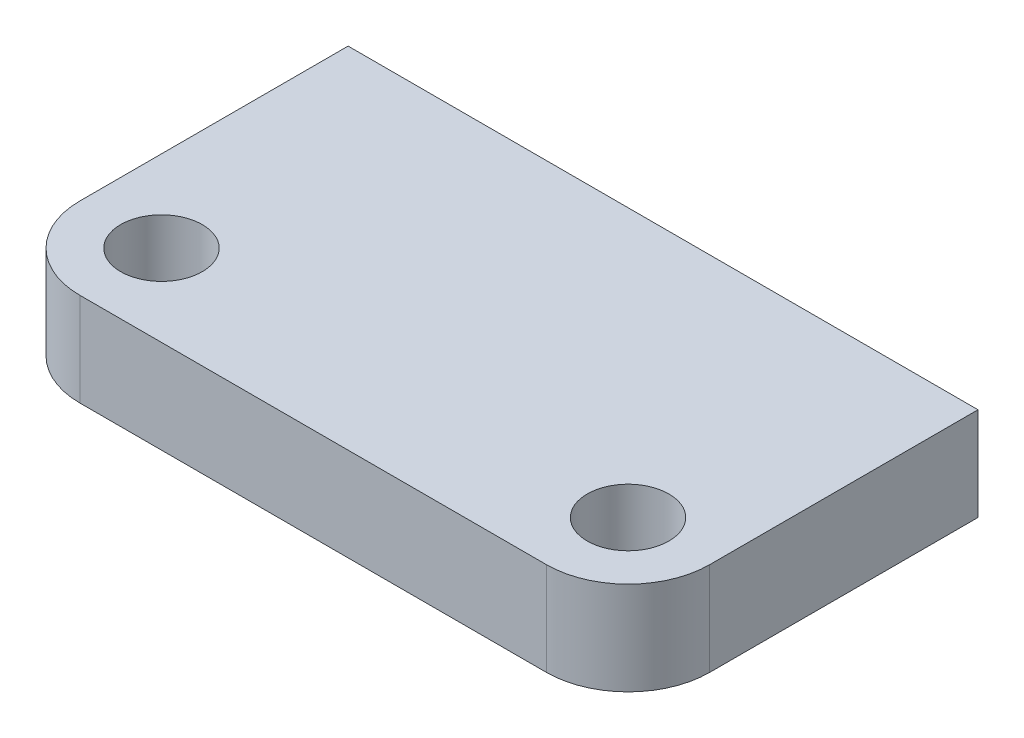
ISO-10303-21;
HEADER;
FILE_DESCRIPTION(('STEP AP214'),'2;1');
FILE_NAME('part.step','',(''),(''),'','','');
FILE_SCHEMA(('AUTOMOTIVE_DESIGN { 1 0 10303 214 1 1 1 1 }'));
ENDSEC;
DATA;
#1=APPLICATION_CONTEXT('core data for automotive mechanical design processes');
#2=APPLICATION_PROTOCOL_DEFINITION('international standard','automotive_design',2000,#1);
#3=PRODUCT_CONTEXT('',#1,'mechanical');
#4=PRODUCT('Part','Part','',(#3));
#5=PRODUCT_RELATED_PRODUCT_CATEGORY('part','',(#4));
#6=PRODUCT_DEFINITION_FORMATION('','',#4);
#7=PRODUCT_DEFINITION_CONTEXT('part definition',#1,'design');
#8=PRODUCT_DEFINITION('design','',#6,#7);
#9=PRODUCT_DEFINITION_SHAPE('','',#8);
#10=(LENGTH_UNIT() NAMED_UNIT(*) SI_UNIT(.MILLI.,.METRE.));
#11=(NAMED_UNIT(*) PLANE_ANGLE_UNIT() SI_UNIT($,.RADIAN.));
#12=(NAMED_UNIT(*) SI_UNIT($,.STERADIAN.) SOLID_ANGLE_UNIT());
#13=UNCERTAINTY_MEASURE_WITH_UNIT(LENGTH_MEASURE(1.E-05),#10,'distance_accuracy_value','');
#14=(GEOMETRIC_REPRESENTATION_CONTEXT(3) GLOBAL_UNCERTAINTY_ASSIGNED_CONTEXT((#13)) GLOBAL_UNIT_ASSIGNED_CONTEXT((#10,
#11,#12)) REPRESENTATION_CONTEXT('',''));
#15=CARTESIAN_POINT('',(0.,0.,0.));
#16=DIRECTION('',(0.,0.,1.));
#17=DIRECTION('',(1.,0.,0.));
#18=AXIS2_PLACEMENT_3D('',#15,#16,#17);
#19=CARTESIAN_POINT('',(-20.,8.,23.));
#20=DIRECTION('',(0.,-1.,0.));
#21=DIRECTION('',(0.,0.,-1.));
#22=AXIS2_PLACEMENT_3D('',#19,#20,#21);
#23=PLANE('',#22);
#24=CARTESIAN_POINT('',(-20.,8.,23.));
#25=DIRECTION('',(0.,1.,0.));
#26=DIRECTION('',(0.,0.,1.));
#27=AXIS2_PLACEMENT_3D('',#24,#25,#26);
#28=CIRCLE('',#27,3.5);
#29=CARTESIAN_POINT('',(-20.,8.,26.5));
#30=VERTEX_POINT('',#29);
#31=EDGE_CURVE('E120',#30,#30,#28,.T.);
#32=ORIENTED_EDGE('',*,*,#31,.F.);
#33=EDGE_LOOP('',(#32));
#34=FACE_BOUND('',#33,.T.);
#35=DIRECTION('',(0.,0.,1.));
#36=VECTOR('',#35,1.);
#37=CARTESIAN_POINT('',(-27.,8.,0.));
#38=LINE('',#37,#36);
#39=CARTESIAN_POINT('',(-27.,8.,0.));
#40=VERTEX_POINT('',#39);
#41=CARTESIAN_POINT('',(-27.,8.,23.));
#42=VERTEX_POINT('',#41);
#43=EDGE_CURVE('E127',#40,#42,#38,.T.);
#44=ORIENTED_EDGE('',*,*,#43,.T.);
#45=CARTESIAN_POINT('',(-20.,8.,23.));
#46=DIRECTION('',(0.,1.,0.));
#47=DIRECTION('',(0.,0.,-1.));
#48=AXIS2_PLACEMENT_3D('',#45,#46,#47);
#49=CIRCLE('',#48,7.);
#50=CARTESIAN_POINT('',(-19.9999999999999,8.,30.));
#51=VERTEX_POINT('',#50);
#52=EDGE_CURVE('E85',#42,#51,#49,.T.);
#53=ORIENTED_EDGE('',*,*,#52,.T.);
#54=DIRECTION('',(1.,0.,0.));
#55=VECTOR('',#54,1.);
#56=CARTESIAN_POINT('',(-19.9999999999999,8.,30.));
#57=LINE('',#56,#55);
#58=CARTESIAN_POINT('',(19.9999999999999,8.,30.));
#59=VERTEX_POINT('',#58);
#60=EDGE_CURVE('E98',#51,#59,#57,.T.);
#61=ORIENTED_EDGE('',*,*,#60,.T.);
#62=CARTESIAN_POINT('',(20.,8.,23.));
#63=DIRECTION('',(0.,1.,0.));
#64=DIRECTION('',(0.,0.,1.));
#65=AXIS2_PLACEMENT_3D('',#62,#63,#64);
#66=CIRCLE('',#65,7.);
#67=CARTESIAN_POINT('',(27.,8.,23.));
#68=VERTEX_POINT('',#67);
#69=EDGE_CURVE('E92',#59,#68,#66,.T.);
#70=ORIENTED_EDGE('',*,*,#69,.T.);
#71=DIRECTION('',(0.,0.,-1.));
#72=VECTOR('',#71,1.);
#73=CARTESIAN_POINT('',(27.,8.,0.));
#74=LINE('',#73,#72);
#75=CARTESIAN_POINT('',(27.,8.,0.));
#76=VERTEX_POINT('',#75);
#77=EDGE_CURVE('E96',#68,#76,#74,.T.);
#78=ORIENTED_EDGE('',*,*,#77,.T.);
#79=DIRECTION('',(-1.,0.,0.));
#80=VECTOR('',#79,1.);
#81=CARTESIAN_POINT('',(27.,8.,0.));
#82=LINE('',#81,#80);
#83=EDGE_CURVE('E48',#76,#40,#82,.T.);
#84=ORIENTED_EDGE('',*,*,#83,.T.);
#85=EDGE_LOOP('',(#44,#53,#61,#70,#78,#84));
#86=FACE_BOUND('',#85,.T.);
#87=CARTESIAN_POINT('',(20.,8.,23.));
#88=DIRECTION('',(0.,1.,0.));
#89=DIRECTION('',(0.,0.,-1.));
#90=AXIS2_PLACEMENT_3D('',#87,#88,#89);
#91=CIRCLE('',#90,3.5);
#92=CARTESIAN_POINT('',(20.,8.,19.5));
#93=VERTEX_POINT('',#92);
#94=EDGE_CURVE('E170',#93,#93,#91,.T.);
#95=ORIENTED_EDGE('',*,*,#94,.F.);
#96=EDGE_LOOP('',(#95));
#97=FACE_BOUND('',#96,.T.);
#98=ADVANCED_FACE('F31',(#34,#86,#97),#23,.F.);
#99=CARTESIAN_POINT('',(-20.,0.,23.));
#100=DIRECTION('',(0.,-1.,0.));
#101=DIRECTION('',(0.,0.,-1.));
#102=AXIS2_PLACEMENT_3D('',#99,#100,#101);
#103=PLANE('',#102);
#104=CARTESIAN_POINT('',(-20.,0.,23.));
#105=DIRECTION('',(0.,1.,0.));
#106=DIRECTION('',(0.,0.,1.));
#107=AXIS2_PLACEMENT_3D('',#104,#105,#106);
#108=CIRCLE('',#107,3.5);
#109=CARTESIAN_POINT('',(-20.,0.,26.5));
#110=VERTEX_POINT('',#109);
#111=EDGE_CURVE('E175',#110,#110,#108,.T.);
#112=ORIENTED_EDGE('',*,*,#111,.T.);
#113=EDGE_LOOP('',(#112));
#114=FACE_BOUND('',#113,.T.);
#115=DIRECTION('',(0.,0.,1.));
#116=VECTOR('',#115,1.);
#117=CARTESIAN_POINT('',(-27.,0.,0.));
#118=LINE('',#117,#116);
#119=CARTESIAN_POINT('',(-27.,0.,0.));
#120=VERTEX_POINT('',#119);
#121=CARTESIAN_POINT('',(-27.,0.,23.));
#122=VERTEX_POINT('',#121);
#123=EDGE_CURVE('E116',#120,#122,#118,.T.);
#124=ORIENTED_EDGE('',*,*,#123,.F.);
#125=DIRECTION('',(-1.,0.,0.));
#126=VECTOR('',#125,1.);
#127=CARTESIAN_POINT('',(27.,0.,0.));
#128=LINE('',#127,#126);
#129=CARTESIAN_POINT('',(27.,0.,0.));
#130=VERTEX_POINT('',#129);
#131=EDGE_CURVE('E77',#130,#120,#128,.T.);
#132=ORIENTED_EDGE('',*,*,#131,.F.);
#133=DIRECTION('',(0.,0.,-1.));
#134=VECTOR('',#133,1.);
#135=CARTESIAN_POINT('',(27.,0.,0.));
#136=LINE('',#135,#134);
#137=CARTESIAN_POINT('',(27.,0.,23.));
#138=VERTEX_POINT('',#137);
#139=EDGE_CURVE('E71',#138,#130,#136,.T.);
#140=ORIENTED_EDGE('',*,*,#139,.F.);
#141=CARTESIAN_POINT('',(20.,0.,23.));
#142=DIRECTION('',(0.,1.,0.));
#143=DIRECTION('',(0.,0.,1.));
#144=AXIS2_PLACEMENT_3D('',#141,#142,#143);
#145=CIRCLE('',#144,7.);
#146=CARTESIAN_POINT('',(19.9999999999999,0.,30.));
#147=VERTEX_POINT('',#146);
#148=EDGE_CURVE('E106',#147,#138,#145,.T.);
#149=ORIENTED_EDGE('',*,*,#148,.F.);
#150=DIRECTION('',(1.,0.,0.));
#151=VECTOR('',#150,1.);
#152=CARTESIAN_POINT('',(-19.9999999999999,0.,30.));
#153=LINE('',#152,#151);
#154=CARTESIAN_POINT('',(-19.9999999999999,0.,30.));
#155=VERTEX_POINT('',#154);
#156=EDGE_CURVE('E122',#155,#147,#153,.T.);
#157=ORIENTED_EDGE('',*,*,#156,.F.);
#158=CARTESIAN_POINT('',(-20.,0.,23.));
#159=DIRECTION('',(0.,1.,0.));
#160=DIRECTION('',(0.,0.,-1.));
#161=AXIS2_PLACEMENT_3D('',#158,#159,#160);
#162=CIRCLE('',#161,7.);
#163=EDGE_CURVE('E119',#122,#155,#162,.T.);
#164=ORIENTED_EDGE('',*,*,#163,.F.);
#165=EDGE_LOOP('',(#124,#132,#140,#149,#157,#164));
#166=FACE_BOUND('',#165,.T.);
#167=CARTESIAN_POINT('',(20.,0.,23.));
#168=DIRECTION('',(0.,1.,0.));
#169=DIRECTION('',(0.,0.,-1.));
#170=AXIS2_PLACEMENT_3D('',#167,#168,#169);
#171=CIRCLE('',#170,3.5);
#172=CARTESIAN_POINT('',(20.,0.,19.5));
#173=VERTEX_POINT('',#172);
#174=EDGE_CURVE('E173',#173,#173,#171,.T.);
#175=ORIENTED_EDGE('',*,*,#174,.T.);
#176=EDGE_LOOP('',(#175));
#177=FACE_BOUND('',#176,.T.);
#178=ADVANCED_FACE('F136',(#114,#166,#177),#103,.T.);
#179=CARTESIAN_POINT('',(-27.,8.,0.));
#180=DIRECTION('',(1.,0.,0.));
#181=DIRECTION('',(0.,0.,-1.));
#182=AXIS2_PLACEMENT_3D('',#179,#180,#181);
#183=PLANE('',#182);
#184=ORIENTED_EDGE('',*,*,#123,.T.);
#185=DIRECTION('',(0.,-1.,0.));
#186=VECTOR('',#185,1.);
#187=CARTESIAN_POINT('',(-27.,8.,23.));
#188=LINE('',#187,#186);
#189=EDGE_CURVE('E11',#42,#122,#188,.T.);
#190=ORIENTED_EDGE('',*,*,#189,.F.);
#191=ORIENTED_EDGE('',*,*,#43,.F.);
#192=DIRECTION('',(0.,-1.,0.));
#193=VECTOR('',#192,1.);
#194=CARTESIAN_POINT('',(-27.,8.,0.));
#195=LINE('',#194,#193);
#196=EDGE_CURVE('E112',#40,#120,#195,.T.);
#197=ORIENTED_EDGE('',*,*,#196,.T.);
#198=EDGE_LOOP('',(#184,#190,#191,#197));
#199=FACE_BOUND('',#198,.T.);
#200=ADVANCED_FACE('F33',(#199),#183,.F.);
#201=CARTESIAN_POINT('',(-20.,8.,23.));
#202=DIRECTION('',(0.,-1.,0.));
#203=DIRECTION('',(0.,0.,-1.));
#204=AXIS2_PLACEMENT_3D('',#201,#202,#203);
#205=CYLINDRICAL_SURFACE('',#204,7.);
#206=ORIENTED_EDGE('',*,*,#163,.T.);
#207=DIRECTION('',(0.,-1.,0.));
#208=VECTOR('',#207,1.);
#209=CARTESIAN_POINT('',(-19.9999999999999,8.,30.));
#210=LINE('',#209,#208);
#211=EDGE_CURVE('E40',#51,#155,#210,.T.);
#212=ORIENTED_EDGE('',*,*,#211,.F.);
#213=ORIENTED_EDGE('',*,*,#52,.F.);
#214=ORIENTED_EDGE('',*,*,#189,.T.);
#215=EDGE_LOOP('',(#206,#212,#213,#214));
#216=FACE_BOUND('',#215,.T.);
#217=ADVANCED_FACE('F216',(#216),#205,.T.);
#218=CARTESIAN_POINT('',(-19.9999999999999,8.,30.));
#219=DIRECTION('',(0.,0.,-1.));
#220=DIRECTION('',(-1.,0.,0.));
#221=AXIS2_PLACEMENT_3D('',#218,#219,#220);
#222=PLANE('',#221);
#223=ORIENTED_EDGE('',*,*,#156,.T.);
#224=DIRECTION('',(0.,-1.,0.));
#225=VECTOR('',#224,1.);
#226=CARTESIAN_POINT('',(19.9999999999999,8.,30.));
#227=LINE('',#226,#225);
#228=EDGE_CURVE('E107',#59,#147,#227,.T.);
#229=ORIENTED_EDGE('',*,*,#228,.F.);
#230=ORIENTED_EDGE('',*,*,#60,.F.);
#231=ORIENTED_EDGE('',*,*,#211,.T.);
#232=EDGE_LOOP('',(#223,#229,#230,#231));
#233=FACE_BOUND('',#232,.T.);
#234=ADVANCED_FACE('F133',(#233),#222,.F.);
#235=CARTESIAN_POINT('',(20.,8.,23.));
#236=DIRECTION('',(0.,-1.,0.));
#237=DIRECTION('',(0.,0.,-1.));
#238=AXIS2_PLACEMENT_3D('',#235,#236,#237);
#239=CYLINDRICAL_SURFACE('',#238,7.);
#240=ORIENTED_EDGE('',*,*,#148,.T.);
#241=DIRECTION('',(0.,-1.,0.));
#242=VECTOR('',#241,1.);
#243=CARTESIAN_POINT('',(27.,8.,23.));
#244=LINE('',#243,#242);
#245=EDGE_CURVE('E103',#68,#138,#244,.T.);
#246=ORIENTED_EDGE('',*,*,#245,.F.);
#247=ORIENTED_EDGE('',*,*,#69,.F.);
#248=ORIENTED_EDGE('',*,*,#228,.T.);
#249=EDGE_LOOP('',(#240,#246,#247,#248));
#250=FACE_BOUND('',#249,.T.);
#251=ADVANCED_FACE('F104',(#250),#239,.T.);
#252=CARTESIAN_POINT('',(27.,8.,0.));
#253=DIRECTION('',(-1.,0.,0.));
#254=DIRECTION('',(0.,0.,1.));
#255=AXIS2_PLACEMENT_3D('',#252,#253,#254);
#256=PLANE('',#255);
#257=ORIENTED_EDGE('',*,*,#139,.T.);
#258=DIRECTION('',(0.,-1.,0.));
#259=VECTOR('',#258,1.);
#260=CARTESIAN_POINT('',(27.,8.,0.));
#261=LINE('',#260,#259);
#262=EDGE_CURVE('E108',#76,#130,#261,.T.);
#263=ORIENTED_EDGE('',*,*,#262,.F.);
#264=ORIENTED_EDGE('',*,*,#77,.F.);
#265=ORIENTED_EDGE('',*,*,#245,.T.);
#266=EDGE_LOOP('',(#257,#263,#264,#265));
#267=FACE_BOUND('',#266,.T.);
#268=ADVANCED_FACE('F110',(#267),#256,.F.);
#269=CARTESIAN_POINT('',(27.,8.,0.));
#270=DIRECTION('',(0.,0.,1.));
#271=DIRECTION('',(1.,0.,0.));
#272=AXIS2_PLACEMENT_3D('',#269,#270,#271);
#273=PLANE('',#272);
#274=ORIENTED_EDGE('',*,*,#131,.T.);
#275=ORIENTED_EDGE('',*,*,#196,.F.);
#276=ORIENTED_EDGE('',*,*,#83,.F.);
#277=ORIENTED_EDGE('',*,*,#262,.T.);
#278=EDGE_LOOP('',(#274,#275,#276,#277));
#279=FACE_BOUND('',#278,.T.);
#280=ADVANCED_FACE('F141',(#279),#273,.F.);
#281=CARTESIAN_POINT('',(-20.,8.,23.));
#282=DIRECTION('',(0.,-1.,0.));
#283=DIRECTION('',(0.,0.,-1.));
#284=AXIS2_PLACEMENT_3D('',#281,#282,#283);
#285=CYLINDRICAL_SURFACE('',#284,3.5);
#286=ORIENTED_EDGE('',*,*,#31,.T.);
#287=EDGE_LOOP('',(#286));
#288=FACE_BOUND('',#287,.T.);
#289=ORIENTED_EDGE('',*,*,#111,.F.);
#290=EDGE_LOOP('',(#289));
#291=FACE_BOUND('',#290,.T.);
#292=ADVANCED_FACE('F143',(#288,#291),#285,.F.);
#293=CARTESIAN_POINT('',(20.,8.,23.));
#294=DIRECTION('',(0.,-1.,0.));
#295=DIRECTION('',(0.,0.,-1.));
#296=AXIS2_PLACEMENT_3D('',#293,#294,#295);
#297=CYLINDRICAL_SURFACE('',#296,3.5);
#298=ORIENTED_EDGE('',*,*,#94,.T.);
#299=EDGE_LOOP('',(#298));
#300=FACE_BOUND('',#299,.T.);
#301=ORIENTED_EDGE('',*,*,#174,.F.);
#302=EDGE_LOOP('',(#301));
#303=FACE_BOUND('',#302,.T.);
#304=ADVANCED_FACE('F149',(#300,#303),#297,.F.);
#305=CLOSED_SHELL('',(#98,#178,#200,#217,#234,#251,#268,#280,#292,#304));
#306=MANIFOLD_SOLID_BREP('B2',#305);
#307=ADVANCED_BREP_SHAPE_REPRESENTATION('',(#18,#306),#14);
#308=SHAPE_DEFINITION_REPRESENTATION(#9,#307);
ENDSEC;
END-ISO-10303-21;
